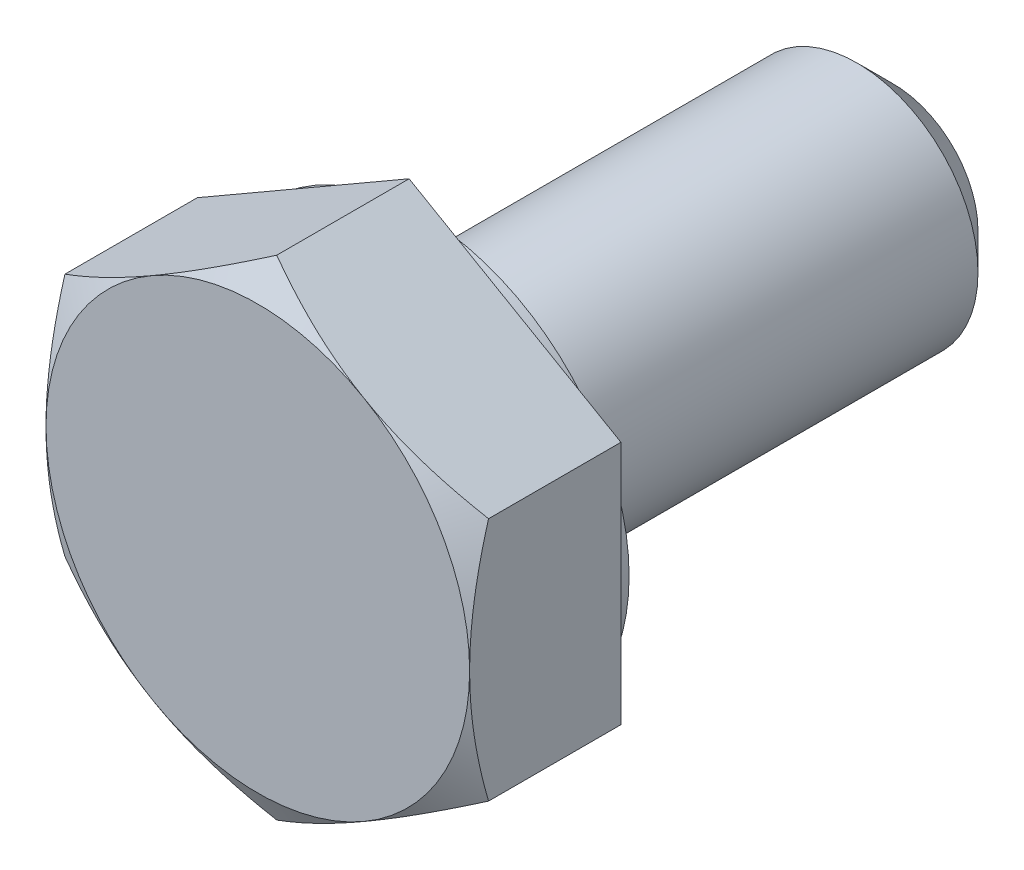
ISO-10303-21;
HEADER;
FILE_DESCRIPTION(('STEP AP214'),'2;1');
FILE_NAME('part.step','',(''),(''),'','','');
FILE_SCHEMA(('AUTOMOTIVE_DESIGN { 1 0 10303 214 1 1 1 1 }'));
ENDSEC;
DATA;
#1=APPLICATION_CONTEXT('core data for automotive mechanical design processes');
#2=APPLICATION_PROTOCOL_DEFINITION('international standard','automotive_design',2000,#1);
#3=PRODUCT_CONTEXT('',#1,'mechanical');
#4=PRODUCT('Part','Part','',(#3));
#5=PRODUCT_RELATED_PRODUCT_CATEGORY('part','',(#4));
#6=PRODUCT_DEFINITION_FORMATION('','',#4);
#7=PRODUCT_DEFINITION_CONTEXT('part definition',#1,'design');
#8=PRODUCT_DEFINITION('design','',#6,#7);
#9=PRODUCT_DEFINITION_SHAPE('','',#8);
#10=(LENGTH_UNIT() NAMED_UNIT(*) SI_UNIT(.MILLI.,.METRE.));
#11=(NAMED_UNIT(*) PLANE_ANGLE_UNIT() SI_UNIT($,.RADIAN.));
#12=(NAMED_UNIT(*) SI_UNIT($,.STERADIAN.) SOLID_ANGLE_UNIT());
#13=UNCERTAINTY_MEASURE_WITH_UNIT(LENGTH_MEASURE(1.E-05),#10,'distance_accuracy_value','');
#14=(GEOMETRIC_REPRESENTATION_CONTEXT(3) GLOBAL_UNCERTAINTY_ASSIGNED_CONTEXT((#13)) GLOBAL_UNIT_ASSIGNED_CONTEXT((#10,
#11,#12)) REPRESENTATION_CONTEXT('',''));
#15=CARTESIAN_POINT('',(0.,0.,0.));
#16=DIRECTION('',(0.,0.,1.));
#17=DIRECTION('',(1.,0.,0.));
#18=AXIS2_PLACEMENT_3D('',#15,#16,#17);
#19=CARTESIAN_POINT('',(5.55624999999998,3.20790243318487,3.96875));
#20=DIRECTION('',(-0.499999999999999,-0.866025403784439,0.));
#21=DIRECTION('',(0.866025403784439,-0.5,0.));
#22=AXIS2_PLACEMENT_3D('',#19,#20,#21);
#23=PLANE('',#22);
#24=CARTESIAN_POINT('',(5.55644999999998,3.20778696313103,3.47241909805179));
#25=CARTESIAN_POINT('',(5.43431700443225,3.278300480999,3.51312443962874));
#26=CARTESIAN_POINT('',(5.31172863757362,3.34907690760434,3.55198246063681));
#27=CARTESIAN_POINT('',(5.06555635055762,3.49120454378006,3.62549506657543));
#28=CARTESIAN_POINT('',(4.94197202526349,3.56255598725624,3.66014783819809));
#29=CARTESIAN_POINT('',(4.56924027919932,3.77775276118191,3.75711811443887));
#30=CARTESIAN_POINT('',(4.31862154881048,3.92244755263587,3.81227394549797));
#31=CARTESIAN_POINT('',(3.94357517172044,4.1389806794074,3.876951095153));
#32=CARTESIAN_POINT('',(3.82026814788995,4.2101720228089,3.89537582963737));
#33=CARTESIAN_POINT('',(3.57309692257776,4.35287639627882,3.92627163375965));
#34=CARTESIAN_POINT('',(3.44923277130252,4.42438939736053,3.93874322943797));
#35=CARTESIAN_POINT('',(3.20128932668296,4.56753961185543,3.95741491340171));
#36=CARTESIAN_POINT('',(3.07721043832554,4.63917659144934,3.96362211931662));
#37=CARTESIAN_POINT('',(2.82894487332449,4.78251278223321,3.96963858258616));
#38=CARTESIAN_POINT('',(2.70475820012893,4.85421199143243,3.96944803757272));
#39=CARTESIAN_POINT('',(2.36452243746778,5.05064720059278,3.96013175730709));
#40=CARTESIAN_POINT('',(2.14858470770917,5.17531890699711,3.94449034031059));
#41=CARTESIAN_POINT('',(1.71814349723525,5.42383425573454,3.89489009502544));
#42=CARTESIAN_POINT('',(1.50364153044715,5.54767702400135,3.86091431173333));
#43=CARTESIAN_POINT('',(1.07233397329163,5.79669255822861,3.77598424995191));
#44=CARTESIAN_POINT('',(0.855582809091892,5.92183390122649,3.72467011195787));
#45=CARTESIAN_POINT('',(0.425312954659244,6.17025031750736,3.6082075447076));
#46=CARTESIAN_POINT('',(0.21178875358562,6.29352857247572,3.54308647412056));
#47=CARTESIAN_POINT('',(-0.000200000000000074,6.41592033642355,3.47241909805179));
#48=B_SPLINE_CURVE_WITH_KNOTS('',3,(#24,#25,#26,#27,#28,#29,#30,#31,#32,#33,#34,#35,#36,#37,#38,
#39,#40,#41,#42,#43,#44,#45,#46,#47),.UNSPECIFIED.,.F.,.F.,(4,2,2,2,2,2,2,2,2,2,2,4),(0.,
0.44031690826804,0.880823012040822,1.76366572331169,2.19427472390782,2.62484566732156,
3.05492684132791,3.48499472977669,4.23370964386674,4.98311813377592,5.74914806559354,
6.5136740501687),.UNSPECIFIED.);
#49=CARTESIAN_POINT('',(5.55624999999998,3.20790243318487,3.4724857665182));
#50=VERTEX_POINT('',#49);
#51=CARTESIAN_POINT('',(2.778125,4.81185364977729,3.96875));
#52=VERTEX_POINT('',#51);
#53=EDGE_CURVE('E116',#50,#52,#48,.T.);
#54=ORIENTED_EDGE('',*,*,#53,.F.);
#55=DIRECTION('',(0.,0.,-1.));
#56=VECTOR('',#55,1.);
#57=CARTESIAN_POINT('',(5.55624999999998,3.20790243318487,3.96875));
#58=LINE('',#57,#56);
#59=CARTESIAN_POINT('',(5.55624999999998,3.20790243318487,0.));
#60=VERTEX_POINT('',#59);
#61=EDGE_CURVE('E65',#50,#60,#58,.T.);
#62=ORIENTED_EDGE('',*,*,#61,.T.);
#63=DIRECTION('',(-0.866025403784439,0.499999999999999,0.));
#64=VECTOR('',#63,1.);
#65=CARTESIAN_POINT('',(5.55624999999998,3.20790243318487,0.));
#66=LINE('',#65,#64);
#67=CARTESIAN_POINT('',(0.,6.41580486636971,0.));
#68=VERTEX_POINT('',#67);
#69=EDGE_CURVE('E250',#60,#68,#66,.T.);
#70=ORIENTED_EDGE('',*,*,#69,.T.);
#71=DIRECTION('',(0.,0.,-1.));
#72=VECTOR('',#71,1.);
#73=CARTESIAN_POINT('',(0.,6.41580486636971,3.96875));
#74=LINE('',#73,#72);
#75=CARTESIAN_POINT('',(0.,6.41580486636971,3.4724857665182));
#76=VERTEX_POINT('',#75);
#77=EDGE_CURVE('E139',#76,#68,#74,.T.);
#78=ORIENTED_EDGE('',*,*,#77,.F.);
#79=EDGE_CURVE('E121',#52,#76,#48,.T.);
#80=ORIENTED_EDGE('',*,*,#79,.F.);
#81=EDGE_LOOP('',(#54,#62,#70,#78,#80));
#82=FACE_BOUND('',#81,.T.);
#83=ADVANCED_FACE('F45',(#82),#23,.F.);
#84=CARTESIAN_POINT('',(0.,6.41580486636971,3.96875));
#85=DIRECTION('',(0.5,-0.866025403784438,0.));
#86=DIRECTION('',(0.866025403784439,0.5,0.));
#87=AXIS2_PLACEMENT_3D('',#84,#85,#86);
#88=PLANE('',#87);
#89=CARTESIAN_POINT('',(0.000199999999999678,6.41592033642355,3.47241909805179));
#90=CARTESIAN_POINT('',(-0.121932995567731,6.34540681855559,3.51312443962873));
#91=CARTESIAN_POINT('',(-0.244521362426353,6.27463039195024,3.5519824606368));
#92=CARTESIAN_POINT('',(-0.490693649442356,6.13250275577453,3.62549506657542));
#93=CARTESIAN_POINT('',(-0.614277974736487,6.06115131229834,3.66014783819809));
#94=CARTESIAN_POINT('',(-0.987009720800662,5.84595453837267,3.75711811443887));
#95=CARTESIAN_POINT('',(-1.2376284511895,5.70125974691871,3.81227394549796));
#96=CARTESIAN_POINT('',(-1.61267482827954,5.48472662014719,3.87695109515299));
#97=CARTESIAN_POINT('',(-1.73598185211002,5.41353527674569,3.89537582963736));
#98=CARTESIAN_POINT('',(-1.98315307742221,5.27083090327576,3.92627163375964));
#99=CARTESIAN_POINT('',(-2.10701722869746,5.19931790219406,3.93874322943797));
#100=CARTESIAN_POINT('',(-2.35496067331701,5.05616768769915,3.95741491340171));
#101=CARTESIAN_POINT('',(-2.47903956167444,4.98453070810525,3.96362211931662));
#102=CARTESIAN_POINT('',(-2.72730512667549,4.84119451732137,3.96963858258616));
#103=CARTESIAN_POINT('',(-2.85149179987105,4.76949530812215,3.96944803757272));
#104=CARTESIAN_POINT('',(-3.19172756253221,4.5730600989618,3.9601317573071));
#105=CARTESIAN_POINT('',(-3.40766529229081,4.44838839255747,3.94449034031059));
#106=CARTESIAN_POINT('',(-3.83810650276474,4.19987304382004,3.89489009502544));
#107=CARTESIAN_POINT('',(-4.05260846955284,4.07603027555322,3.86091431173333));
#108=CARTESIAN_POINT('',(-4.48391602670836,3.82701474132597,3.77598424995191));
#109=CARTESIAN_POINT('',(-4.7006671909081,3.70187339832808,3.72467011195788));
#110=CARTESIAN_POINT('',(-5.13093704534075,3.45345698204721,3.6082075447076));
#111=CARTESIAN_POINT('',(-5.34446124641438,3.33017872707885,3.54308647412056));
#112=CARTESIAN_POINT('',(-5.55645,3.20778696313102,3.47241909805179));
#113=B_SPLINE_CURVE_WITH_KNOTS('',3,(#89,#90,#91,#92,#93,#94,#95,#96,#97,#98,#99,#100,#101,#102,
#103,#104,#105,#106,#107,#108,#109,#110,#111,#112),.UNSPECIFIED.,.F.,.F.,(4,2,2,2,2,2,2,2,2,2,2,
4),(0.,0.440316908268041,0.880823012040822,1.76366572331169,2.19427472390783,2.62484566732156,
3.05492684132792,3.48499472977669,4.23370964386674,4.98311813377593,5.74914806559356,
6.51367405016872),.UNSPECIFIED.);
#114=CARTESIAN_POINT('',(-2.778125,4.81185364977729,3.96875));
#115=VERTEX_POINT('',#114);
#116=EDGE_CURVE('E128',#76,#115,#113,.T.);
#117=ORIENTED_EDGE('',*,*,#116,.F.);
#118=ORIENTED_EDGE('',*,*,#77,.T.);
#119=DIRECTION('',(-0.866025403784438,-0.5,0.));
#120=VECTOR('',#119,1.);
#121=CARTESIAN_POINT('',(0.,6.41580486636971,0.));
#122=LINE('',#121,#120);
#123=CARTESIAN_POINT('',(-5.55625,3.20790243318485,0.));
#124=VERTEX_POINT('',#123);
#125=EDGE_CURVE('E279',#68,#124,#122,.T.);
#126=ORIENTED_EDGE('',*,*,#125,.T.);
#127=DIRECTION('',(0.,0.,-1.));
#128=VECTOR('',#127,1.);
#129=CARTESIAN_POINT('',(-5.55625,3.20790243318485,3.96875));
#130=LINE('',#129,#128);
#131=CARTESIAN_POINT('',(-5.55625,3.20790243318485,3.4724857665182));
#132=VERTEX_POINT('',#131);
#133=EDGE_CURVE('E208',#132,#124,#130,.T.);
#134=ORIENTED_EDGE('',*,*,#133,.F.);
#135=EDGE_CURVE('E136',#115,#132,#113,.T.);
#136=ORIENTED_EDGE('',*,*,#135,.F.);
#137=EDGE_LOOP('',(#117,#118,#126,#134,#136));
#138=FACE_BOUND('',#137,.T.);
#139=ADVANCED_FACE('F197',(#138),#88,.F.);
#140=CARTESIAN_POINT('',(-5.55625,3.20790243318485,3.96875));
#141=DIRECTION('',(1.,0.,0.));
#142=DIRECTION('',(0.,1.,0.));
#143=AXIS2_PLACEMENT_3D('',#140,#141,#142);
#144=PLANE('',#143);
#145=CARTESIAN_POINT('',(-5.55624999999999,-8.71597197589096,1.20895936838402));
#146=CARTESIAN_POINT('',(-5.55624999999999,-8.47241296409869,1.32750261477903));
#147=CARTESIAN_POINT('',(-5.55624999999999,-8.22830531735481,1.44493743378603));
#148=CARTESIAN_POINT('',(-5.55624999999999,-7.73870130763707,1.67696863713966));
#149=CARTESIAN_POINT('',(-5.55624999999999,-7.49320474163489,1.79156459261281));
#150=CARTESIAN_POINT('',(-5.55624999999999,-6.99931388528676,2.01785180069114));
#151=CARTESIAN_POINT('',(-5.55624999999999,-6.75091115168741,2.1295246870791));
#152=CARTESIAN_POINT('',(-5.55624999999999,-6.2521639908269,2.3484300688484));
#153=CARTESIAN_POINT('',(-5.55624999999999,-6.00181965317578,2.45566276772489));
#154=CARTESIAN_POINT('',(-5.55624999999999,-5.49040404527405,2.66800096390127));
#155=CARTESIAN_POINT('',(-5.55624999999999,-5.22925341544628,2.77291633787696));
#156=CARTESIAN_POINT('',(-5.55624999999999,-4.70393363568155,2.97504404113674));
#157=CARTESIAN_POINT('',(-5.55624999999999,-4.43976415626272,3.07225552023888));
#158=CARTESIAN_POINT('',(-5.55624999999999,-3.90845027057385,3.25649660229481));
#159=CARTESIAN_POINT('',(-5.55625,-3.64131278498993,3.34354597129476));
#160=CARTESIAN_POINT('',(-5.55625,-3.10320429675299,3.50473464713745));
#161=CARTESIAN_POINT('',(-5.55625,-2.832234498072,3.57887791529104));
#162=CARTESIAN_POINT('',(-5.55625,-2.28781102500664,3.71037429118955));
#163=CARTESIAN_POINT('',(-5.55625,-2.01438008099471,3.76782003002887));
#164=CARTESIAN_POINT('',(-5.55625,-1.46397793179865,3.86272174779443));
#165=CARTESIAN_POINT('',(-5.55625,-1.18700710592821,3.9001798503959));
#166=CARTESIAN_POINT('',(-5.55625,-0.771839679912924,3.93889421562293));
#167=CARTESIAN_POINT('',(-5.55625,-0.634423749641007,3.94887693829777));
#168=CARTESIAN_POINT('',(-5.55625,-0.359297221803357,3.96302182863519));
#169=CARTESIAN_POINT('',(-5.55625,-0.22158665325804,3.96718454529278));
#170=CARTESIAN_POINT('',(-5.55625,0.0538978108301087,3.96958502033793));
#171=CARTESIAN_POINT('',(-5.55625,0.191671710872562,3.96782225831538));
#172=CARTESIAN_POINT('',(-5.55625,0.467008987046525,3.95841701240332));
#173=CARTESIAN_POINT('',(-5.55625,0.604572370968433,3.95077475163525));
#174=CARTESIAN_POINT('',(-5.55625,0.932168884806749,3.92573817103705));
#175=CARTESIAN_POINT('',(-5.55625,1.12200607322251,3.90572161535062));
#176=CARTESIAN_POINT('',(-5.55625,1.50032750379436,3.85556055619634));
#177=CARTESIAN_POINT('',(-5.55625,1.68881157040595,3.82541476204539));
#178=CARTESIAN_POINT('',(-5.55625,2.25198169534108,3.72137741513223));
#179=CARTESIAN_POINT('',(-5.55625,2.62419475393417,3.63390247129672));
#180=CARTESIAN_POINT('',(-5.55625,3.18100797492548,3.48146888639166));
#181=CARTESIAN_POINT('',(-5.55625,3.36847421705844,3.42637134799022));
#182=CARTESIAN_POINT('',(-5.55625,3.74158722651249,3.31027130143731));
#183=CARTESIAN_POINT('',(-5.55625,3.92723398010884,3.24926874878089));
#184=CARTESIAN_POINT('',(-5.55625,4.29676489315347,3.12235263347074));
#185=CARTESIAN_POINT('',(-5.55625,4.48064955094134,3.05644050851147));
#186=CARTESIAN_POINT('',(-5.55625,4.84688123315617,2.92049906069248));
#187=CARTESIAN_POINT('',(-5.55625,5.02922829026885,2.85046982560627));
#188=CARTESIAN_POINT('',(-5.55625,5.51260356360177,2.65956817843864));
#189=CARTESIAN_POINT('',(-5.55625,5.81243783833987,2.53567575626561));
#190=CARTESIAN_POINT('',(-5.55625,6.4090880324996,2.28079960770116));
#191=CARTESIAN_POINT('',(-5.55625,6.70590363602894,2.14981514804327));
#192=CARTESIAN_POINT('',(-5.55625,7.29719433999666,1.88240435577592));
#193=CARTESIAN_POINT('',(-5.55625,7.59166855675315,1.74597607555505));
#194=CARTESIAN_POINT('',(-5.55625,8.17863205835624,1.46895611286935));
#195=CARTESIAN_POINT('',(-5.55625,8.47112141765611,1.32836458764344));
#196=CARTESIAN_POINT('',(-5.55625,9.05495036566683,1.0436931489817));
#197=CARTESIAN_POINT('',(-5.55625,9.3462874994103,0.899608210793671));
#198=CARTESIAN_POINT('',(-5.55625,9.92765328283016,0.608821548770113));
#199=CARTESIAN_POINT('',(-5.55625,10.2176819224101,0.462119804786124));
#200=CARTESIAN_POINT('',(-5.55625,11.086043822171,0.0189390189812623));
#201=CARTESIAN_POINT('',(-5.55625,11.6627758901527,-0.280676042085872));
#202=CARTESIAN_POINT('',(-5.55625,12.75396623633,-0.854339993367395));
#203=CARTESIAN_POINT('',(-5.55625,13.2687144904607,-1.12783995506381));
#204=CARTESIAN_POINT('',(-5.55625,14.2964629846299,-1.67817398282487));
#205=CARTESIAN_POINT('',(-5.55625000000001,14.8094631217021,-1.95500824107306));
#206=CARTESIAN_POINT('',(-5.55625000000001,15.8324606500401,-2.51025174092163));
#207=CARTESIAN_POINT('',(-5.55625000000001,16.3424623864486,-2.78865298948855));
#208=CARTESIAN_POINT('',(-5.55625000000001,17.3613731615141,-3.34735795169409));
#209=CARTESIAN_POINT('',(-5.55625000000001,17.8702822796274,-3.62766152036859));
#210=CARTESIAN_POINT('',(-5.55625000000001,18.3788054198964,-3.90865921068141));
#211=B_SPLINE_CURVE_WITH_KNOTS('',3,(#145,#146,#147,#148,#149,#150,#151,#152,#153,#154,#155,
#156,#157,#158,#159,#160,#161,#162,#163,#164,#165,#166,#167,#168,#169,#170,#171,#172,#173,#174,
#175,#176,#177,#178,#179,#180,#181,#182,#183,#184,#185,#186,#187,#188,#189,#190,#191,#192,#193,
#194,#195,#196,#197,#198,#199,#200,#201,#202,#203,#204,#205,#206,#207,#208,#209,#210),
.UNSPECIFIED.,.F.,.F.,(4,2,2,2,2,2,2,2,2,2,2,2,2,2,2,2,2,2,2,2,2,2,2,2,2,2,2,2,2,2,2,2,4),(0.,
0.8126357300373,1.62539348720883,2.44240990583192,3.25938883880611,4.10360649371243,
4.94791718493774,5.79055725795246,6.63293823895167,7.4705527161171,8.30807817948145,
8.72130784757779,9.13449853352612,9.54772550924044,9.96093680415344,10.5332843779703,
11.1057049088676,12.2511183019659,12.8372525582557,13.4233912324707,14.0093589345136,
14.5953141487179,15.5684465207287,16.5416797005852,17.5152642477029,18.4888120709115,
19.4638547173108,20.4389048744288,22.3885945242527,24.1372706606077,25.8860480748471,
27.6291677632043,29.3721560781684),.UNSPECIFIED.);
#212=CARTESIAN_POINT('',(-5.55625,0.,3.96875));
#213=VERTEX_POINT('',#212);
#214=EDGE_CURVE('E192',#132,#213,#211,.F.);
#215=ORIENTED_EDGE('',*,*,#214,.F.);
#216=ORIENTED_EDGE('',*,*,#133,.T.);
#217=DIRECTION('',(0.,-1.,0.));
#218=VECTOR('',#217,1.);
#219=CARTESIAN_POINT('',(-5.55625,3.20790243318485,0.));
#220=LINE('',#219,#218);
#221=CARTESIAN_POINT('',(-5.55625,-3.20790243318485,0.));
#222=VERTEX_POINT('',#221);
#223=EDGE_CURVE('E226',#124,#222,#220,.T.);
#224=ORIENTED_EDGE('',*,*,#223,.T.);
#225=DIRECTION('',(0.,0.,-1.));
#226=VECTOR('',#225,1.);
#227=CARTESIAN_POINT('',(-5.55625,-3.20790243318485,3.96875));
#228=LINE('',#227,#226);
#229=CARTESIAN_POINT('',(-5.55625,-3.20790243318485,3.4724857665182));
#230=VERTEX_POINT('',#229);
#231=EDGE_CURVE('E228',#230,#222,#228,.T.);
#232=ORIENTED_EDGE('',*,*,#231,.F.);
#233=EDGE_CURVE('E187',#213,#230,#211,.F.);
#234=ORIENTED_EDGE('',*,*,#233,.F.);
#235=EDGE_LOOP('',(#215,#216,#224,#232,#234));
#236=FACE_BOUND('',#235,.T.);
#237=ADVANCED_FACE('F193',(#236),#144,.F.);
#238=CARTESIAN_POINT('',(-5.55625,-3.20790243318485,3.96875));
#239=DIRECTION('',(0.5,0.866025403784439,0.));
#240=DIRECTION('',(-0.866025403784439,0.5,0.));
#241=AXIS2_PLACEMENT_3D('',#238,#239,#240);
#242=PLANE('',#241);
#243=CARTESIAN_POINT('',(-5.55644999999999,-3.20778696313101,3.47241909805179));
#244=CARTESIAN_POINT('',(-5.43431700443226,-3.27830048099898,3.51312443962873));
#245=CARTESIAN_POINT('',(-5.31172863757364,-3.34907690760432,3.55198246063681));
#246=CARTESIAN_POINT('',(-5.06555635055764,-3.49120454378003,3.62549506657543));
#247=CARTESIAN_POINT('',(-4.94197202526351,-3.56255598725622,3.66014783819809));
#248=CARTESIAN_POINT('',(-4.56924027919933,-3.77775276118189,3.75711811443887));
#249=CARTESIAN_POINT('',(-4.31862154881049,-3.92244755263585,3.81227394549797));
#250=CARTESIAN_POINT('',(-3.94357517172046,-4.13898067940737,3.876951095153));
#251=CARTESIAN_POINT('',(-3.82026814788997,-4.21017202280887,3.89537582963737));
#252=CARTESIAN_POINT('',(-3.57309692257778,-4.3528763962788,3.92627163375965));
#253=CARTESIAN_POINT('',(-3.44923277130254,-4.42438939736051,3.93874322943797));
#254=CARTESIAN_POINT('',(-3.20128932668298,-4.56753961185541,3.95741491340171));
#255=CARTESIAN_POINT('',(-3.07721043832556,-4.63917659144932,3.96362211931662));
#256=CARTESIAN_POINT('',(-2.82894487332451,-4.78251278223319,3.96963858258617));
#257=CARTESIAN_POINT('',(-2.70475820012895,-4.85421199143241,3.96944803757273));
#258=CARTESIAN_POINT('',(-2.36452243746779,-5.05064720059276,3.9601317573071));
#259=CARTESIAN_POINT('',(-2.14858470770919,-5.17531890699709,3.94449034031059));
#260=CARTESIAN_POINT('',(-1.71814349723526,-5.42383425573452,3.89489009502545));
#261=CARTESIAN_POINT('',(-1.50364153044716,-5.54767702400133,3.86091431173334));
#262=CARTESIAN_POINT('',(-1.07233397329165,-5.79669255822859,3.77598424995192));
#263=CARTESIAN_POINT('',(-0.855582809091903,-5.92183390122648,3.72467011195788));
#264=CARTESIAN_POINT('',(-0.425312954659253,-6.17025031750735,3.60820754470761));
#265=CARTESIAN_POINT('',(-0.211788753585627,-6.29352857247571,3.54308647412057));
#266=CARTESIAN_POINT('',(0.000199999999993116,-6.41592033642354,3.4724190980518));
#267=B_SPLINE_CURVE_WITH_KNOTS('',3,(#243,#244,#245,#246,#247,#248,#249,#250,#251,#252,#253,
#254,#255,#256,#257,#258,#259,#260,#261,#262,#263,#264,#265,#266),.UNSPECIFIED.,.F.,.F.,(4,2,2,
2,2,2,2,2,2,2,2,4),(0.,0.44031690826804,0.880823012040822,1.76366572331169,2.19427472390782,
2.62484566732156,3.05492684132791,3.48499472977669,4.23370964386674,4.98311813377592,
5.74914806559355,6.51367405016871),.UNSPECIFIED.);
#268=CARTESIAN_POINT('',(-2.778125,-4.81185364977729,3.96875));
#269=VERTEX_POINT('',#268);
#270=EDGE_CURVE('E194',#230,#269,#267,.T.);
#271=ORIENTED_EDGE('',*,*,#270,.F.);
#272=ORIENTED_EDGE('',*,*,#231,.T.);
#273=DIRECTION('',(0.866025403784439,-0.5,0.));
#274=VECTOR('',#273,1.);
#275=CARTESIAN_POINT('',(-5.55625,-3.20790243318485,0.));
#276=LINE('',#275,#274);
#277=CARTESIAN_POINT('',(0.,-6.4158048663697,0.));
#278=VERTEX_POINT('',#277);
#279=EDGE_CURVE('E273',#222,#278,#276,.T.);
#280=ORIENTED_EDGE('',*,*,#279,.T.);
#281=DIRECTION('',(0.,0.,-1.));
#282=VECTOR('',#281,1.);
#283=CARTESIAN_POINT('',(0.,-6.4158048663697,3.96875));
#284=LINE('',#283,#282);
#285=CARTESIAN_POINT('',(0.,-6.4158048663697,3.4724857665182));
#286=VERTEX_POINT('',#285);
#287=EDGE_CURVE('E235',#286,#278,#284,.T.);
#288=ORIENTED_EDGE('',*,*,#287,.F.);
#289=EDGE_CURVE('E179',#269,#286,#267,.T.);
#290=ORIENTED_EDGE('',*,*,#289,.F.);
#291=EDGE_LOOP('',(#271,#272,#280,#288,#290));
#292=FACE_BOUND('',#291,.T.);
#293=ADVANCED_FACE('F199',(#292),#242,.F.);
#294=CARTESIAN_POINT('',(0.,-6.4158048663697,3.96875));
#295=DIRECTION('',(-0.5,0.866025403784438,0.));
#296=DIRECTION('',(-0.866025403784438,-0.5,0.));
#297=AXIS2_PLACEMENT_3D('',#294,#295,#296);
#298=PLANE('',#297);
#299=CARTESIAN_POINT('',(-0.000200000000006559,-6.41592033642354,3.47241909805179));
#300=CARTESIAN_POINT('',(0.121932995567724,-6.34540681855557,3.51312443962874));
#301=CARTESIAN_POINT('',(0.244521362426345,-6.27463039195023,3.55198246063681));
#302=CARTESIAN_POINT('',(0.490693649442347,-6.13250275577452,3.62549506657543));
#303=CARTESIAN_POINT('',(0.614277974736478,-6.06115131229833,3.6601478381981));
#304=CARTESIAN_POINT('',(0.987009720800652,-5.84595453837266,3.75711811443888));
#305=CARTESIAN_POINT('',(1.23762845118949,-5.7012597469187,3.81227394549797));
#306=CARTESIAN_POINT('',(1.61267482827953,-5.48472662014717,3.876951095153));
#307=CARTESIAN_POINT('',(1.73598185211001,-5.41353527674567,3.89537582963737));
#308=CARTESIAN_POINT('',(1.9831530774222,-5.27083090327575,3.92627163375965));
#309=CARTESIAN_POINT('',(2.10701722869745,-5.19931790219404,3.93874322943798));
#310=CARTESIAN_POINT('',(2.354960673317,-5.05616768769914,3.95741491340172));
#311=CARTESIAN_POINT('',(2.47903956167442,-4.98453070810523,3.96362211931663));
#312=CARTESIAN_POINT('',(2.72730512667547,-4.84119451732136,3.96963858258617));
#313=CARTESIAN_POINT('',(2.85149179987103,-4.76949530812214,3.96944803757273));
#314=CARTESIAN_POINT('',(3.19172756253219,-4.57306009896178,3.96013175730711));
#315=CARTESIAN_POINT('',(3.40766529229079,-4.44838839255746,3.9444903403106));
#316=CARTESIAN_POINT('',(3.83810650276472,-4.19987304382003,3.89489009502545));
#317=CARTESIAN_POINT('',(4.05260846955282,-4.07603027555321,3.86091431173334));
#318=CARTESIAN_POINT('',(4.48391602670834,-3.82701474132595,3.77598424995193));
#319=CARTESIAN_POINT('',(4.70066719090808,-3.70187339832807,3.72467011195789));
#320=CARTESIAN_POINT('',(5.13093704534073,-3.4534569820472,3.60820754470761));
#321=CARTESIAN_POINT('',(5.34446124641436,-3.33017872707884,3.54308647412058));
#322=CARTESIAN_POINT('',(5.55644999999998,-3.20778696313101,3.4724190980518));
#323=B_SPLINE_CURVE_WITH_KNOTS('',3,(#299,#300,#301,#302,#303,#304,#305,#306,#307,#308,#309,
#310,#311,#312,#313,#314,#315,#316,#317,#318,#319,#320,#321,#322),.UNSPECIFIED.,.F.,.F.,(4,2,2,
2,2,2,2,2,2,2,2,4),(0.,0.440316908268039,0.88082301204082,1.76366572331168,2.19427472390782,
2.62484566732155,3.05492684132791,3.48499472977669,4.23370964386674,4.98311813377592,
5.74914806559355,6.51367405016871),.UNSPECIFIED.);
#324=CARTESIAN_POINT('',(2.778125,-4.81185364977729,3.96875));
#325=VERTEX_POINT('',#324);
#326=EDGE_CURVE('E258',#286,#325,#323,.T.);
#327=ORIENTED_EDGE('',*,*,#326,.F.);
#328=ORIENTED_EDGE('',*,*,#287,.T.);
#329=DIRECTION('',(0.866025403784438,0.5,0.));
#330=VECTOR('',#329,1.);
#331=CARTESIAN_POINT('',(0.,-6.4158048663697,0.));
#332=LINE('',#331,#330);
#333=CARTESIAN_POINT('',(5.55624999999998,-3.20790243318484,0.));
#334=VERTEX_POINT('',#333);
#335=EDGE_CURVE('E272',#278,#334,#332,.T.);
#336=ORIENTED_EDGE('',*,*,#335,.T.);
#337=DIRECTION('',(0.,0.,-1.));
#338=VECTOR('',#337,1.);
#339=CARTESIAN_POINT('',(5.55624999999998,-3.20790243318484,3.96875));
#340=LINE('',#339,#338);
#341=CARTESIAN_POINT('',(5.55624999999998,-3.2079024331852,3.47248576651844));
#342=VERTEX_POINT('',#341);
#343=EDGE_CURVE('E232',#342,#334,#340,.T.);
#344=ORIENTED_EDGE('',*,*,#343,.F.);
#345=EDGE_CURVE('E173',#325,#342,#323,.T.);
#346=ORIENTED_EDGE('',*,*,#345,.F.);
#347=EDGE_LOOP('',(#327,#328,#336,#344,#346));
#348=FACE_BOUND('',#347,.T.);
#349=ADVANCED_FACE('F259',(#348),#298,.F.);
#350=CARTESIAN_POINT('',(5.55624999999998,-3.20790243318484,3.96875));
#351=DIRECTION('',(-1.,0.,0.));
#352=DIRECTION('',(0.,-1.,0.));
#353=AXIS2_PLACEMENT_3D('',#350,#351,#352);
#354=PLANE('',#353);
#355=CARTESIAN_POINT('',(5.55624999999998,-8.71597197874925,1.20895936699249));
#356=CARTESIAN_POINT('',(5.55624999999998,-8.47241296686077,1.32750261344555));
#357=CARTESIAN_POINT('',(5.55624999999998,-8.22830532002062,1.44493743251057));
#358=CARTESIAN_POINT('',(5.55624999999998,-7.73870131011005,1.67696863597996));
#359=CARTESIAN_POINT('',(5.55624999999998,-7.49320474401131,1.79156459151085));
#360=CARTESIAN_POINT('',(5.55624999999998,-6.99931388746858,2.01785179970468));
#361=CARTESIAN_POINT('',(5.55624999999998,-6.7509111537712,2.12952468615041));
#362=CARTESIAN_POINT('',(5.55624999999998,-6.25216399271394,2.34843006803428));
#363=CARTESIAN_POINT('',(5.55624999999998,-6.00181965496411,2.45566276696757));
#364=CARTESIAN_POINT('',(5.55624999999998,-5.49040404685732,2.66800096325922));
#365=CARTESIAN_POINT('',(5.55624999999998,-5.22925341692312,2.77291633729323));
#366=CARTESIAN_POINT('',(5.55624999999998,-4.70393363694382,2.97504404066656));
#367=CARTESIAN_POINT('',(5.55624999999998,-4.43976415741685,3.07225551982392));
#368=CARTESIAN_POINT('',(5.55624999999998,-3.9084502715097,3.25649660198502));
#369=CARTESIAN_POINT('',(5.55624999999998,-3.64131278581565,3.34354597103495));
#370=CARTESIAN_POINT('',(5.55624999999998,-3.10320429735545,3.50473464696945));
#371=CARTESIAN_POINT('',(5.55624999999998,-2.83223449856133,3.5788779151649));
#372=CARTESIAN_POINT('',(5.55624999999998,-2.28781102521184,3.71037429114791));
#373=CARTESIAN_POINT('',(5.55624999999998,-2.01438008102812,3.76782003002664));
#374=CARTESIAN_POINT('',(5.55624999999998,-1.46397793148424,3.86272174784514));
#375=CARTESIAN_POINT('',(5.55624999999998,-1.18700710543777,3.90017985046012));
#376=CARTESIAN_POINT('',(5.55624999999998,-0.771839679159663,3.93889421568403));
#377=CARTESIAN_POINT('',(5.55624999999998,-0.634423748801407,3.94887693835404));
#378=CARTESIAN_POINT('',(5.55624999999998,-0.359297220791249,3.96302182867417));
#379=CARTESIAN_POINT('',(5.55624999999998,-0.221586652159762,3.96718454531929));
#380=CARTESIAN_POINT('',(5.55624999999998,0.0538978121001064,3.96958502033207));
#381=CARTESIAN_POINT('',(5.55624999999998,0.191671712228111,3.96782225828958));
#382=CARTESIAN_POINT('',(5.55624999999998,0.467008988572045,3.95841701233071));
#383=CARTESIAN_POINT('',(5.55624999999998,0.604572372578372,3.95077475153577));
#384=CARTESIAN_POINT('',(5.55624999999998,0.932168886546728,3.9257381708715));
#385=CARTESIAN_POINT('',(5.55624999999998,1.12200607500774,3.90572161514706));
#386=CARTESIAN_POINT('',(5.55624999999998,1.50032750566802,3.85556055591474));
#387=CARTESIAN_POINT('',(5.55624999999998,1.68881157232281,3.82541476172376));
#388=CARTESIAN_POINT('',(5.55624999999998,2.25198169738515,3.72137741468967));
#389=CARTESIAN_POINT('',(5.55624999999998,2.6241947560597,3.63390247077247));
#390=CARTESIAN_POINT('',(5.55624999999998,3.18100797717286,3.48146888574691));
#391=CARTESIAN_POINT('',(5.55624999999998,3.3684742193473,3.42637134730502));
#392=CARTESIAN_POINT('',(5.55624999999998,3.74158722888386,3.31027130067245));
#393=CARTESIAN_POINT('',(5.55624999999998,3.92723398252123,3.24926874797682));
#394=CARTESIAN_POINT('',(5.55624999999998,4.29676489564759,3.12235263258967));
#395=CARTESIAN_POINT('',(5.55624999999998,4.48064955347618,3.0564405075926));
#396=CARTESIAN_POINT('',(5.55624999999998,4.84688123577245,2.92049905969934));
#397=CARTESIAN_POINT('',(5.55624999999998,5.02922829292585,2.85046982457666));
#398=CARTESIAN_POINT('',(5.55624999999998,5.51260356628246,2.65956817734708));
#399=CARTESIAN_POINT('',(5.55624999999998,5.81243784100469,2.53567575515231));
#400=CARTESIAN_POINT('',(5.55624999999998,6.40908803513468,2.28079960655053));
#401=CARTESIAN_POINT('',(5.55624999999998,6.70590363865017,2.14981514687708));
#402=CARTESIAN_POINT('',(5.55624999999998,7.29719434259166,1.8824043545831));
#403=CARTESIAN_POINT('',(5.55624999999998,7.59166855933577,1.74597607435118));
#404=CARTESIAN_POINT('',(5.55624999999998,8.17863206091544,1.46895611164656));
#405=CARTESIAN_POINT('',(5.55624999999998,8.47112142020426,1.3283645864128));
#406=CARTESIAN_POINT('',(5.55624999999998,9.05495036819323,1.04369314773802));
#407=CARTESIAN_POINT('',(5.55624999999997,9.34628750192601,0.899608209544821));
#408=CARTESIAN_POINT('',(5.55624999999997,9.92765328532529,0.608821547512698));
#409=CARTESIAN_POINT('',(5.55624999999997,10.2176819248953,0.462119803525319));
#410=CARTESIAN_POINT('',(5.55624999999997,11.0860438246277,0.0189390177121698));
#411=CARTESIAN_POINT('',(5.55624999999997,11.6627758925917,-0.280676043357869));
#412=CARTESIAN_POINT('',(5.55624999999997,12.7539662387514,-0.854339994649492));
#413=CARTESIAN_POINT('',(5.55624999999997,13.2687144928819,-1.12783995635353));
#414=CARTESIAN_POINT('',(5.55624999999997,14.2964629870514,-1.67817398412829));
#415=CARTESIAN_POINT('',(5.55624999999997,14.8094631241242,-1.95500824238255));
#416=CARTESIAN_POINT('',(5.55624999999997,15.8324606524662,-2.51025174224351));
#417=CARTESIAN_POINT('',(5.55624999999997,16.3424623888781,-2.78865299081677));
#418=CARTESIAN_POINT('',(5.55624999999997,17.3613731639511,-3.34735795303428));
#419=CARTESIAN_POINT('',(5.55624999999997,17.8702822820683,-3.62766152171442));
#420=CARTESIAN_POINT('',(5.55624999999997,18.3788054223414,-3.90865921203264));
#421=B_SPLINE_CURVE_WITH_KNOTS('',3,(#355,#356,#357,#358,#359,#360,#361,#362,#363,#364,#365,
#366,#367,#368,#369,#370,#371,#372,#373,#374,#375,#376,#377,#378,#379,#380,#381,#382,#383,#384,
#385,#386,#387,#388,#389,#390,#391,#392,#393,#394,#395,#396,#397,#398,#399,#400,#401,#402,#403,
#404,#405,#406,#407,#408,#409,#410,#411,#412,#413,#414,#415,#416,#417,#418,#419,#420),
.UNSPECIFIED.,.F.,.F.,(4,2,2,2,2,2,2,2,2,2,2,2,2,2,2,2,2,2,2,2,2,2,2,2,2,2,2,2,2,2,2,2,4),(0.,
0.812635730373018,1.62539348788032,2.44240990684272,3.25938884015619,4.10360649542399,
4.94791718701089,5.79055726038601,6.63293824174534,7.47055271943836,8.30807818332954,
8.72130785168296,9.13449853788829,9.54772551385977,9.96093680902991,10.5332843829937,
11.1057049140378,12.2511183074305,12.837252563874,13.4233912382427,14.0093589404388,
14.5953141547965,15.5684465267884,16.5416797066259,17.5152642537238,18.4888120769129,
19.4638547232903,20.4389048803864,22.3885945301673,24.1372706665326,25.8860480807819,
27.6291677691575,29.3721560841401),.UNSPECIFIED.);
#422=CARTESIAN_POINT('',(5.55624999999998,0.,3.96875));
#423=VERTEX_POINT('',#422);
#424=EDGE_CURVE('E265',#342,#423,#421,.T.);
#425=ORIENTED_EDGE('',*,*,#424,.F.);
#426=ORIENTED_EDGE('',*,*,#343,.T.);
#427=DIRECTION('',(0.,1.,0.));
#428=VECTOR('',#427,1.);
#429=CARTESIAN_POINT('',(5.55624999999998,-3.20790243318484,0.));
#430=LINE('',#429,#428);
#431=EDGE_CURVE('E270',#334,#60,#430,.T.);
#432=ORIENTED_EDGE('',*,*,#431,.T.);
#433=ORIENTED_EDGE('',*,*,#61,.F.);
#434=EDGE_CURVE('E122',#423,#50,#421,.T.);
#435=ORIENTED_EDGE('',*,*,#434,.F.);
#436=EDGE_LOOP('',(#425,#426,#432,#433,#435));
#437=FACE_BOUND('',#436,.T.);
#438=ADVANCED_FACE('F269',(#437),#354,.F.);
#439=CARTESIAN_POINT('',(0.,0.,0.));
#440=DIRECTION('',(0.,0.,1.));
#441=DIRECTION('',(1.,0.,0.));
#442=AXIS2_PLACEMENT_3D('',#439,#440,#441);
#443=PLANE('',#442);
#444=CARTESIAN_POINT('',(0.,0.,0.));
#445=DIRECTION('',(0.,0.,1.));
#446=DIRECTION('',(1.,0.,0.));
#447=AXIS2_PLACEMENT_3D('',#444,#445,#446);
#448=CIRCLE('',#447,5.49275);
#449=CARTESIAN_POINT('',(5.49275,0.,0.));
#450=VERTEX_POINT('',#449);
#451=EDGE_CURVE('E239',#450,#450,#448,.F.);
#452=ORIENTED_EDGE('',*,*,#451,.F.);
#453=EDGE_LOOP('',(#452));
#454=FACE_BOUND('',#453,.T.);
#455=ORIENTED_EDGE('',*,*,#69,.F.);
#456=ORIENTED_EDGE('',*,*,#431,.F.);
#457=ORIENTED_EDGE('',*,*,#335,.F.);
#458=ORIENTED_EDGE('',*,*,#279,.F.);
#459=ORIENTED_EDGE('',*,*,#223,.F.);
#460=ORIENTED_EDGE('',*,*,#125,.F.);
#461=EDGE_LOOP('',(#455,#456,#457,#458,#459,#460));
#462=FACE_BOUND('',#461,.T.);
#463=ADVANCED_FACE('F280',(#454,#462),#443,.F.);
#464=CARTESIAN_POINT('',(0.,0.,-0.2778125));
#465=DIRECTION('',(0.,0.,1.));
#466=DIRECTION('',(1.,0.,0.));
#467=AXIS2_PLACEMENT_3D('',#464,#465,#466);
#468=CYLINDRICAL_SURFACE('',#467,5.49275);
#469=CARTESIAN_POINT('',(0.,0.,-0.2778125));
#470=DIRECTION('',(0.,0.,-1.));
#471=DIRECTION('',(-1.,0.,0.));
#472=AXIS2_PLACEMENT_3D('',#469,#470,#471);
#473=CIRCLE('',#472,5.49275);
#474=CARTESIAN_POINT('',(5.49275,0.,-0.2778125));
#475=VERTEX_POINT('',#474);
#476=EDGE_CURVE('E124',#475,#475,#473,.T.);
#477=CARTESIAN_POINT('',(5.49275,0.,-0.2778125));
#478=CARTESIAN_POINT('',(5.49275,0.,-0.274918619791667));
#479=CARTESIAN_POINT('',(5.49275,0.,-0.272024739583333));
#480=CARTESIAN_POINT('',(5.49275,0.,-0.266236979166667));
#481=CARTESIAN_POINT('',(5.49275,0.,-0.263343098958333));
#482=CARTESIAN_POINT('',(5.49275,0.,-0.257555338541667));
#483=CARTESIAN_POINT('',(5.49275,0.,-0.254661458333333));
#484=CARTESIAN_POINT('',(5.49275,0.,-0.248873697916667));
#485=CARTESIAN_POINT('',(5.49275,0.,-0.245979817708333));
#486=CARTESIAN_POINT('',(5.49275,0.,-0.240192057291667));
#487=CARTESIAN_POINT('',(5.49275,0.,-0.237298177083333));
#488=CARTESIAN_POINT('',(5.49275,0.,-0.231510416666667));
#489=CARTESIAN_POINT('',(5.49275,0.,-0.228616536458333));
#490=CARTESIAN_POINT('',(5.49275,0.,-0.222828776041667));
#491=CARTESIAN_POINT('',(5.49275,0.,-0.219934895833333));
#492=CARTESIAN_POINT('',(5.49275,0.,-0.214147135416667));
#493=CARTESIAN_POINT('',(5.49275,0.,-0.211253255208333));
#494=CARTESIAN_POINT('',(5.49275,0.,-0.205465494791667));
#495=CARTESIAN_POINT('',(5.49275,0.,-0.202571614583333));
#496=CARTESIAN_POINT('',(5.49275,0.,-0.196783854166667));
#497=CARTESIAN_POINT('',(5.49275,0.,-0.193889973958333));
#498=CARTESIAN_POINT('',(5.49275,0.,-0.188102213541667));
#499=CARTESIAN_POINT('',(5.49275,0.,-0.185208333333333));
#500=CARTESIAN_POINT('',(5.49275,0.,-0.179420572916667));
#501=CARTESIAN_POINT('',(5.49275,0.,-0.176526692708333));
#502=CARTESIAN_POINT('',(5.49275,0.,-0.170738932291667));
#503=CARTESIAN_POINT('',(5.49275,0.,-0.167845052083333));
#504=CARTESIAN_POINT('',(5.49275,0.,-0.162057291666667));
#505=CARTESIAN_POINT('',(5.49275,0.,-0.159163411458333));
#506=CARTESIAN_POINT('',(5.49275,0.,-0.153375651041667));
#507=CARTESIAN_POINT('',(5.49275,0.,-0.150481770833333));
#508=CARTESIAN_POINT('',(5.49275,0.,-0.144694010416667));
#509=CARTESIAN_POINT('',(5.49275,0.,-0.141800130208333));
#510=CARTESIAN_POINT('',(5.49275,0.,-0.136012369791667));
#511=CARTESIAN_POINT('',(5.49275,0.,-0.133118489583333));
#512=CARTESIAN_POINT('',(5.49275,0.,-0.127330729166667));
#513=CARTESIAN_POINT('',(5.49275,0.,-0.124436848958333));
#514=CARTESIAN_POINT('',(5.49275,0.,-0.118649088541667));
#515=CARTESIAN_POINT('',(5.49275,0.,-0.115755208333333));
#516=CARTESIAN_POINT('',(5.49275,0.,-0.109967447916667));
#517=CARTESIAN_POINT('',(5.49275,0.,-0.107073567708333));
#518=CARTESIAN_POINT('',(5.49275,0.,-0.101285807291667));
#519=CARTESIAN_POINT('',(5.49275,0.,-0.0983919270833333));
#520=CARTESIAN_POINT('',(5.49275,0.,-0.0926041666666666));
#521=CARTESIAN_POINT('',(5.49275,0.,-0.0897102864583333));
#522=CARTESIAN_POINT('',(5.49275,0.,-0.0839225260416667));
#523=CARTESIAN_POINT('',(5.49275,0.,-0.0810286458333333));
#524=CARTESIAN_POINT('',(5.49275,0.,-0.0752408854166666));
#525=CARTESIAN_POINT('',(5.49275,0.,-0.0723470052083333));
#526=CARTESIAN_POINT('',(5.49275,0.,-0.0665592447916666));
#527=CARTESIAN_POINT('',(5.49275,0.,-0.0636653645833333));
#528=CARTESIAN_POINT('',(5.49275,0.,-0.0578776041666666));
#529=CARTESIAN_POINT('',(5.49275,0.,-0.0549837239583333));
#530=CARTESIAN_POINT('',(5.49275,0.,-0.0491959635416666));
#531=CARTESIAN_POINT('',(5.49275,0.,-0.0463020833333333));
#532=CARTESIAN_POINT('',(5.49275,0.,-0.0405143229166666));
#533=CARTESIAN_POINT('',(5.49275,0.,-0.0376204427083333));
#534=CARTESIAN_POINT('',(5.49275,0.,-0.0318326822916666));
#535=CARTESIAN_POINT('',(5.49275,0.,-0.0289388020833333));
#536=CARTESIAN_POINT('',(5.49275,0.,-0.0231510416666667));
#537=CARTESIAN_POINT('',(5.49275,0.,-0.0202571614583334));
#538=CARTESIAN_POINT('',(5.49275,0.,-0.0144694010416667));
#539=CARTESIAN_POINT('',(5.49275,0.,-0.0115755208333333));
#540=CARTESIAN_POINT('',(5.49275,0.,-0.00578776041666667));
#541=CARTESIAN_POINT('',(5.49275,0.,-0.00289388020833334));
#542=CARTESIAN_POINT('',(5.49275,0.,0.));
#543=B_SPLINE_CURVE_WITH_KNOTS('',3,(#477,#478,#479,#480,#481,#482,#483,#484,#485,#486,#487,
#488,#489,#490,#491,#492,#493,#494,#495,#496,#497,#498,#499,#500,#501,#502,#503,#504,#505,#506,
#507,#508,#509,#510,#511,#512,#513,#514,#515,#516,#517,#518,#519,#520,#521,#522,#523,#524,#525,
#526,#527,#528,#529,#530,#531,#532,#533,#534,#535,#536,#537,#538,#539,#540,#541,#542),
.UNSPECIFIED.,.F.,.F.,(4,2,2,2,2,2,2,2,2,2,2,2,2,2,2,2,2,2,2,2,2,2,2,2,2,2,2,2,2,2,2,2,4),(0.,
0.00868164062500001,0.01736328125,0.026044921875,0.0347265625,0.043408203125,0.05208984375,
0.060771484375,0.069453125,0.078134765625,0.08681640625,0.095498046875,0.1041796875,
0.112861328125,0.12154296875,0.130224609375,0.13890625,0.147587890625,0.15626953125,
0.164951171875,0.1736328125,0.182314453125,0.19099609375,0.199677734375,0.208359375,
0.217041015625,0.22572265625,0.234404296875,0.2430859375,0.251767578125,0.26044921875,
0.269130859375,0.2778125),.UNSPECIFIED.);
#544=EDGE_CURVE('BSEAM310',#475,#450,#543,.T.);
#545=ORIENTED_EDGE('',*,*,#476,.F.);
#546=ORIENTED_EDGE('',*,*,#451,.T.);
#547=ORIENTED_EDGE('',*,*,#544,.T.);
#548=ORIENTED_EDGE('',*,*,#544,.F.);
#549=EDGE_LOOP('',(#545,#547,#546,#548));
#550=FACE_BOUND('',#549,.T.);
#551=ADVANCED_FACE('F310',(#550),#468,.T.);
#552=CARTESIAN_POINT('',(0.,0.,-0.2778125));
#553=DIRECTION('',(0.,0.,-1.));
#554=DIRECTION('',(-1.,0.,0.));
#555=AXIS2_PLACEMENT_3D('',#552,#553,#554);
#556=PLANE('',#555);
#557=CARTESIAN_POINT('',(0.,0.,-0.2778125));
#558=DIRECTION('',(0.,0.,-1.));
#559=DIRECTION('',(-1.,0.,0.));
#560=AXIS2_PLACEMENT_3D('',#557,#558,#559);
#561=CIRCLE('',#560,3.175);
#562=CARTESIAN_POINT('',(-3.175,0.,-0.2778125));
#563=VERTEX_POINT('',#562);
#564=EDGE_CURVE('E242',#563,#563,#561,.T.);
#565=ORIENTED_EDGE('',*,*,#564,.F.);
#566=EDGE_LOOP('',(#565));
#567=FACE_BOUND('',#566,.T.);
#568=ORIENTED_EDGE('',*,*,#476,.T.);
#569=EDGE_LOOP('',(#568));
#570=FACE_BOUND('',#569,.T.);
#571=ADVANCED_FACE('F158',(#567,#570),#556,.T.);
#572=CARTESIAN_POINT('',(0.,0.,-12.7));
#573=DIRECTION('',(0.,0.,1.));
#574=DIRECTION('',(1.,0.,0.));
#575=AXIS2_PLACEMENT_3D('',#572,#573,#574);
#576=PLANE('',#575);
#577=CARTESIAN_POINT('',(0.,0.,-12.7));
#578=DIRECTION('',(0.,0.,1.));
#579=DIRECTION('',(1.,0.,0.));
#580=AXIS2_PLACEMENT_3D('',#577,#578,#579);
#581=CIRCLE('',#580,2.2225);
#582=CARTESIAN_POINT('',(2.2225,0.,-12.7));
#583=VERTEX_POINT('',#582);
#584=EDGE_CURVE('E248',#583,#583,#581,.F.);
#585=ORIENTED_EDGE('',*,*,#584,.T.);
#586=EDGE_LOOP('',(#585));
#587=FACE_BOUND('',#586,.T.);
#588=ADVANCED_FACE('F296',(#587),#576,.F.);
#589=CARTESIAN_POINT('',(0.,0.,0.));
#590=DIRECTION('',(0.,0.,1.));
#591=DIRECTION('',(1.,0.,0.));
#592=AXIS2_PLACEMENT_3D('',#589,#590,#591);
#593=CYLINDRICAL_SURFACE('',#592,3.175);
#594=CARTESIAN_POINT('',(0.,0.,-11.7475));
#595=DIRECTION('',(0.,0.,1.));
#596=DIRECTION('',(1.,0.,0.));
#597=AXIS2_PLACEMENT_3D('',#594,#595,#596);
#598=CIRCLE('',#597,3.175);
#599=CARTESIAN_POINT('',(3.175,0.,-11.7475));
#600=VERTEX_POINT('',#599);
#601=EDGE_CURVE('E243',#600,#600,#598,.T.);
#602=ORIENTED_EDGE('',*,*,#601,.T.);
#603=EDGE_LOOP('',(#602));
#604=FACE_BOUND('',#603,.T.);
#605=ORIENTED_EDGE('',*,*,#564,.T.);
#606=EDGE_LOOP('',(#605));
#607=FACE_BOUND('',#606,.T.);
#608=ADVANCED_FACE('F292',(#604,#607),#593,.T.);
#609=CARTESIAN_POINT('',(0.,0.,-11.7475));
#610=DIRECTION('',(0.,0.,1.));
#611=DIRECTION('',(1.,0.,0.));
#612=AXIS2_PLACEMENT_3D('',#609,#610,#611);
#613=CONICAL_SURFACE('',#612,3.175,0.785398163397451);
#614=ORIENTED_EDGE('',*,*,#584,.F.);
#615=EDGE_LOOP('',(#614));
#616=FACE_BOUND('',#615,.T.);
#617=ORIENTED_EDGE('',*,*,#601,.F.);
#618=EDGE_LOOP('',(#617));
#619=FACE_BOUND('',#618,.T.);
#620=ADVANCED_FACE('F42',(#616,#619),#613,.T.);
#621=CARTESIAN_POINT('',(0.,0.,3.96875));
#622=DIRECTION('',(0.,0.,-1.));
#623=DIRECTION('',(1.,0.,0.));
#624=AXIS2_PLACEMENT_3D('',#621,#622,#623);
#625=CONICAL_SURFACE('',#624,5.55625,1.0471975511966);
#626=ORIENTED_EDGE('',*,*,#345,.T.);
#627=ORIENTED_EDGE('',*,*,#424,.T.);
#628=CARTESIAN_POINT('',(0.,0.,3.96875));
#629=DIRECTION('',(0.,0.,1.));
#630=DIRECTION('',(1.,0.,0.));
#631=AXIS2_PLACEMENT_3D('',#628,#629,#630);
#632=CIRCLE('',#631,5.55625);
#633=EDGE_CURVE('E46',#325,#423,#632,.T.);
#634=ORIENTED_EDGE('',*,*,#633,.F.);
#635=EDGE_LOOP('',(#626,#627,#634));
#636=FACE_BOUND('',#635,.T.);
#637=ADVANCED_FACE('F160',(#636),#625,.T.);
#638=ORIENTED_EDGE('',*,*,#289,.T.);
#639=ORIENTED_EDGE('',*,*,#326,.T.);
#640=EDGE_CURVE('E225',#269,#325,#632,.T.);
#641=ORIENTED_EDGE('',*,*,#640,.F.);
#642=EDGE_LOOP('',(#638,#639,#641));
#643=FACE_BOUND('',#642,.T.);
#644=ADVANCED_FACE('F284',(#643),#625,.T.);
#645=ORIENTED_EDGE('',*,*,#233,.T.);
#646=ORIENTED_EDGE('',*,*,#270,.T.);
#647=EDGE_CURVE('E217',#213,#269,#632,.T.);
#648=ORIENTED_EDGE('',*,*,#647,.F.);
#649=EDGE_LOOP('',(#645,#646,#648));
#650=FACE_BOUND('',#649,.T.);
#651=ADVANCED_FACE('F220',(#650),#625,.T.);
#652=ORIENTED_EDGE('',*,*,#135,.T.);
#653=ORIENTED_EDGE('',*,*,#214,.T.);
#654=EDGE_CURVE('E51',#115,#213,#632,.T.);
#655=ORIENTED_EDGE('',*,*,#654,.F.);
#656=EDGE_LOOP('',(#652,#653,#655));
#657=FACE_BOUND('',#656,.T.);
#658=ADVANCED_FACE('F213',(#657),#625,.T.);
#659=ORIENTED_EDGE('',*,*,#79,.T.);
#660=ORIENTED_EDGE('',*,*,#116,.T.);
#661=EDGE_CURVE('E12',#52,#115,#632,.T.);
#662=ORIENTED_EDGE('',*,*,#661,.F.);
#663=EDGE_LOOP('',(#659,#660,#662));
#664=FACE_BOUND('',#663,.T.);
#665=ADVANCED_FACE('F127',(#664),#625,.T.);
#666=ORIENTED_EDGE('',*,*,#53,.T.);
#667=CARTESIAN_POINT('',(0.,0.,3.96875));
#668=DIRECTION('',(0.,0.,1.));
#669=DIRECTION('',(1.,0.,0.));
#670=AXIS2_PLACEMENT_3D('',#667,#668,#669);
#671=CIRCLE('',#670,5.55625);
#672=EDGE_CURVE('E118',#423,#52,#671,.T.);
#673=ORIENTED_EDGE('',*,*,#672,.F.);
#674=ORIENTED_EDGE('',*,*,#434,.T.);
#675=EDGE_LOOP('',(#666,#673,#674));
#676=FACE_BOUND('',#675,.T.);
#677=ADVANCED_FACE('F117',(#676),#625,.T.);
#678=CARTESIAN_POINT('',(0.,0.,3.96875));
#679=DIRECTION('',(0.,0.,1.));
#680=DIRECTION('',(1.,0.,0.));
#681=AXIS2_PLACEMENT_3D('',#678,#679,#680);
#682=PLANE('',#681);
#683=ORIENTED_EDGE('',*,*,#633,.T.);
#684=ORIENTED_EDGE('',*,*,#672,.T.);
#685=ORIENTED_EDGE('',*,*,#661,.T.);
#686=ORIENTED_EDGE('',*,*,#654,.T.);
#687=ORIENTED_EDGE('',*,*,#647,.T.);
#688=ORIENTED_EDGE('',*,*,#640,.T.);
#689=EDGE_LOOP('',(#683,#684,#685,#686,#687,#688));
#690=FACE_BOUND('',#689,.T.);
#691=ADVANCED_FACE('F132',(#690),#682,.T.);
#692=CLOSED_SHELL('',(#83,#139,#237,#293,#349,#438,#463,#551,#571,#588,#608,#620,#637,#644,#651,
#658,#665,#677,#691));
#693=MANIFOLD_SOLID_BREP('B2',#692);
#694=ADVANCED_BREP_SHAPE_REPRESENTATION('',(#18,#693),#14);
#695=SHAPE_DEFINITION_REPRESENTATION(#9,#694);
ENDSEC;
END-ISO-10303-21;
